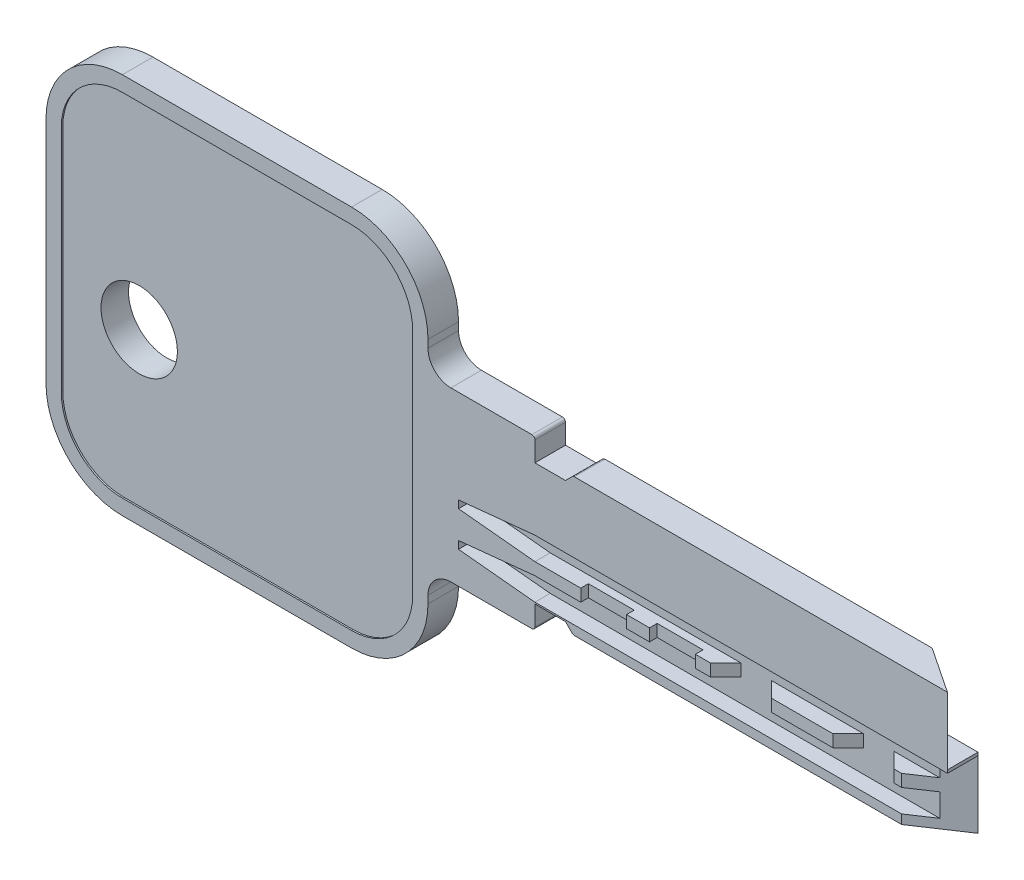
from build123d import *

# Parameters (mm, degrees)
SKETCH1_R            = 2.5
BOSS_EXTRUDE1_DEPTH  = 1
CUT_EXTRUDE2_DEPTH   = 0.1
CUT_EXTRUDE3_DEPTH   = 2
FILLET1_R            = 0.2
FILLET1_OF_MIRROR2_R = 0.2
CUT_EXTRUDE4_DEPTH   = 1
LPATTERN1_COUNT      = 2
LPATTERN1_PITCH      = 2.3
SKETCH5_W            = 3
SKETCH5_H            = 0.8
CUT_EXTRUDE5_DEPTH   = 0.5
CUT_EXTRUDE6_DEPTH   = 0.8
CUT_EXTRUDE7_REACH   = 51.52
CUT_EXTRUDE8_DEPTH   = 1
LPATTERN2_COUNT      = 2
LPATTERN2_PITCH      = 2.3
SKETCH9_W            = 3
SKETCH9_H            = 0.8
CUT_EXTRUDE9_DEPTH   = 0.5
CUT_EXTRUDE10_DEPTH  = 0.8
CUT_EXTRUDE11_REACH  = 51.52


with BuildPart() as part:
    # Sketch1 → Boss-Extrude1 (new, symmetric)
    with BuildSketch(Plane.XY):
        with BuildLine():
            Line((-7.5, 12.5), (7.5, 12.5))
            ThreePointArc((7.5, 12.5), (11.035533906, 11.035533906), (12.5, 7.5))
            Line((12.5, 7.5), (12.5, 7))
            ThreePointArc((12.5, 7), (12.939339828, 5.939339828), (14, 5.5))
            Line((14, 5.5), (46.5, 5.5))
            Line((46.5, 5.5), (46.5, -5.5))
            Line((46.5, -5.5), (14, -5.5))
            ThreePointArc((14, -5.5), (12.939339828, -5.939339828), (12.5, -7))
            Line((12.5, -7), (12.5, -7.5))
            ThreePointArc((12.5, -7.5), (11.035533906, -11.035533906), (7.5, -12.5))
            Line((7.5, -12.5), (-7.5, -12.5))
            ThreePointArc((-7.5, -12.5), (-11.035533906, -11.035533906), (-12.5, -7.5))
            Line((-12.5, -7.5), (-12.5, 7.5))
            ThreePointArc((-12.5, 7.5), (-11.035533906, 11.035533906), (-7.5, 12.5))
        make_face()
        with Locations((-6.5, -1.5)):
            Circle(SKETCH1_R, mode=Mode.SUBTRACT)
    extrude(amount=BOSS_EXTRUDE1_DEPTH, both=True)

    # Sketch2 → Cut-Extrude2 (cut)
    with BuildSketch(Plane.XY.offset(1)):
        with BuildLine():
            Line((11.5, 7), (11.5, 7.5))
            ThreePointArc((11.5, 7.5), (10.328427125, 10.328427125), (7.5, 11.5))
            Line((7.5, 11.5), (-7.5, 11.5))
            ThreePointArc((-7.5, 11.5), (-10.328427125, 10.328427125), (-11.5, 7.5))
            Line((-11.5, 7.5), (-11.5, -7.5))
            ThreePointArc((-11.5, -7.5), (-10.328427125, -10.328427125), (-7.5, -11.5))
            Line((-7.5, -11.5), (7.5, -11.5))
            ThreePointArc((7.5, -11.5), (10.328427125, -10.328427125), (11.5, -7.5))
            Line((11.5, -7.5), (11.5, -7))
            Line((11.5, -7), (11.5, 7))
        make_face()
    cut_extrude2 = extrude(amount=-CUT_EXTRUDE2_DEPTH, mode=Mode.SUBTRACT)

    # Mirror1: Cut-Extrude2 across plane
    add(cut_extrude2.mirror(Plane.XY), mode=Mode.SUBTRACT)

    # Sketch3 → Cut-Extrude3 (cut)
    with BuildSketch(Plane.XY.offset(1)):
        Polygon((19.5, 5.5), (19.5, 4), (21.5, 4), (22, 4.5), (46.5, 4.5), (46.5, 5.5), align=None)
    cut_extrude3 = extrude(amount=-CUT_EXTRUDE3_DEPTH, mode=Mode.SUBTRACT)

    # Fillet1
    fillet1_edges = [part.edges().sort_by_distance(p)[0] for p in [
        (19.5, 5.5, 0),
        (22, 4.5, 0),
    ]]
    fillet(fillet1_edges, radius=FILLET1_R)

    # Mirror2: Cut-Extrude3 across plane
    add(cut_extrude3.mirror(Plane.ZX), mode=Mode.SUBTRACT)

    # Fillet1 of Mirror2
    fillet1_of_mirror2_edges = [part.edges().sort_by_distance(p)[0] for p in [
        (19.5, -5.5, 0),
        (22, -4.5, 0),
    ]]
    fillet(fillet1_of_mirror2_edges, radius=FILLET1_OF_MIRROR2_R)

    # Sketch4 → Cut-Extrude4 (cut)
    with BuildSketch(Plane.XY.offset(1)):
        Polygon((46.5, -0.1), (19.5, -0.1), (14.5, -0.6), (14.5, -1.1), (19.5, -1.6), (46.5, -1.6), align=None)
    cut_extrude4 = extrude(amount=-CUT_EXTRUDE4_DEPTH, mode=Mode.SUBTRACT)

    # LPattern1: Cut-Extrude4 ×2
    with Locations(*[(0, -i * LPATTERN1_PITCH, 0) for i in range(1, LPATTERN1_COUNT)]):
        add(cut_extrude4, mode=Mode.SUBTRACT)

    # Sketch5 → Cut-Extrude5 (cut)
    with BuildSketch(Plane.XY.offset(1)):
        with Locations((24, -2)):
            Rectangle(SKETCH5_W, SKETCH5_H)
        with Locations((28.5, -2)):
            Rectangle(SKETCH5_W, SKETCH5_H)
    extrude(amount=-CUT_EXTRUDE5_DEPTH, mode=Mode.SUBTRACT)

    # Sketch6 → Cut-Extrude6 (cut)
    with BuildSketch(Plane.XZ.offset(2.4)):
        Polygon((35, 1), (31, 1), (32, 0), (34, 0), align=None)
        Polygon((43, 1), (39, 1), (40, 0), (42, 0), align=None)
    extrude(amount=-CUT_EXTRUDE6_DEPTH, mode=Mode.SUBTRACT)

    # Cut-Extrude7: up to this face of the body (flat: up to its plane)
    cut_extrude7_end = Plane(part.part.faces().sort_by_distance((33, -0.1, 0.5))[0])
    # Sketch7 → Cut-Extrude7 (cut, up to the picked face)
    with BuildSketch(Plane.XZ.offset(4.5), mode=Mode.PRIVATE) as cut_extrude7_sk1:
        Polygon((46.5, -1), (43.5, 1), (46.5, 1), align=None)
    cut_extrude7_tool1 = split(extrude(cut_extrude7_sk1.sketch, amount=-CUT_EXTRUDE7_REACH, mode=Mode.PRIVATE), bisect_by=cut_extrude7_end, keep=Keep.BOTH, mode=Mode.PRIVATE)
    add(cut_extrude7_tool1.solids().sort_by(Axis((45.5, -4.5, 0.333333), (0, 1, 0)))[0], mode=Mode.SUBTRACT)

    # Sketch8 → Cut-Extrude8 (cut)
    with BuildSketch(Plane(origin=(0, 0, -1), x_dir=(-1, 0, 0), z_dir=(0, 0, -1))):
        Polygon((-46.5, 0.1), (-19.5, 0.1), (-14.5, 0.6), (-14.5, 1.1), (-19.5, 1.6), (-46.5, 1.6), align=None)
    cut_extrude8 = extrude(amount=-CUT_EXTRUDE8_DEPTH, mode=Mode.SUBTRACT)

    # LPattern2: Cut-Extrude8 ×2
    with Locations(*[(0, i * LPATTERN2_PITCH, 0) for i in range(1, LPATTERN2_COUNT)]):
        add(cut_extrude8, mode=Mode.SUBTRACT)

    # Sketch9 → Cut-Extrude9 (cut)
    with BuildSketch(Plane(origin=(0, 0, -1), x_dir=(-1, 0, 0), z_dir=(0, 0, -1))):
        with Locations((-23, 2)):
            Rectangle(SKETCH9_W, SKETCH9_H)
        with Locations((-27.5, 2)):
            Rectangle(SKETCH9_W, SKETCH9_H)
    extrude(amount=-CUT_EXTRUDE9_DEPTH, mode=Mode.SUBTRACT)

    # Sketch10 → Cut-Extrude10 (cut)
    with BuildSketch(Plane(origin=(0, 2.4, 0), x_dir=(1, 0, 0), z_dir=(0, 1, 0))):
        Polygon((31, 1), (32, 0), (34, 0), (35, 1), align=None)
        Polygon((39, 1), (40, 0), (42, 0), (43, 1), align=None)
    extrude(amount=-CUT_EXTRUDE10_DEPTH, mode=Mode.SUBTRACT)

    # Cut-Extrude11: up to this face of the body (flat: up to its plane)
    cut_extrude11_end = Plane(part.part.faces().sort_by_distance((33, 0.1, -0.5))[0])
    # Sketch11 → Cut-Extrude11 (cut, up to the picked face)
    with BuildSketch(Plane(origin=(0, 4.5, 0), x_dir=(1, 0, 0), z_dir=(0, 1, 0)), mode=Mode.PRIVATE) as cut_extrude11_sk1:
        Polygon((46.5, -1), (43.5, 1), (46.5, 1), align=None)
    cut_extrude11_tool1 = split(extrude(cut_extrude11_sk1.sketch, amount=-CUT_EXTRUDE11_REACH, mode=Mode.PRIVATE), bisect_by=cut_extrude11_end, keep=Keep.BOTH, mode=Mode.PRIVATE)
    add(cut_extrude11_tool1.solids().sort_by(Axis((45.5, 4.5, -0.333333), (0, -1, 0)))[0], mode=Mode.SUBTRACT)


solid = part.part
